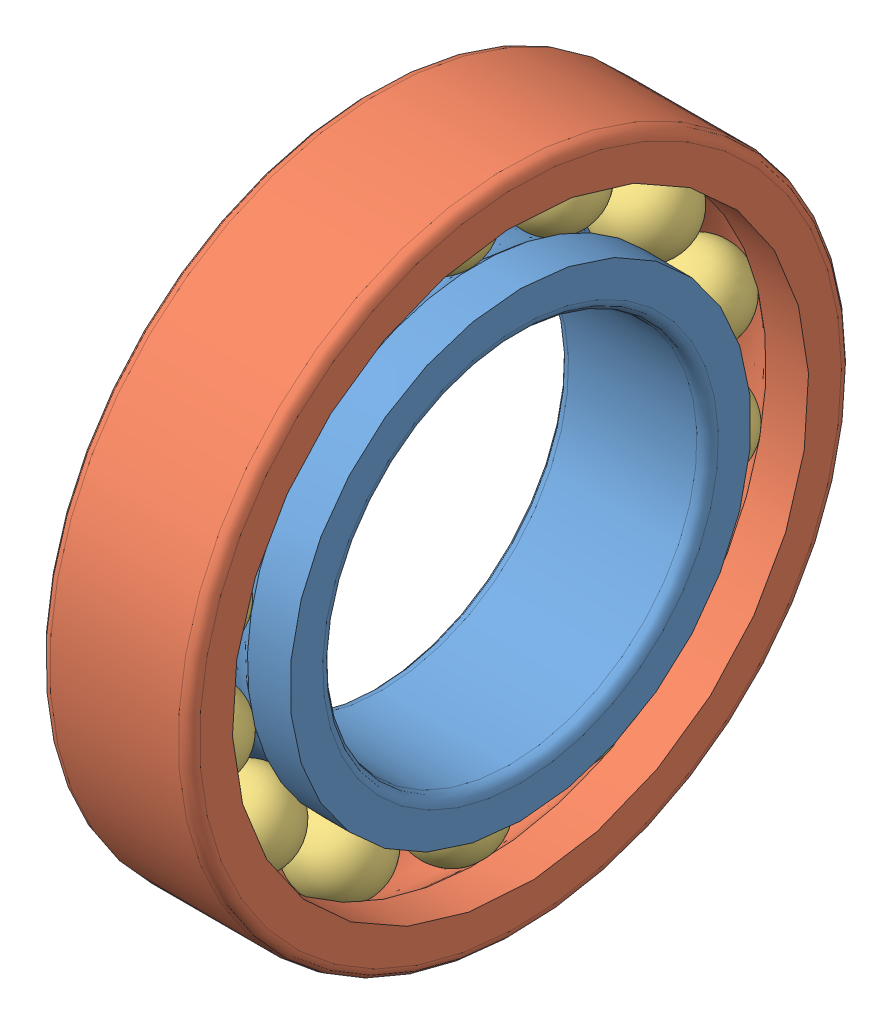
SolidWorks assembly Roulement radial à une rangée de billes 35x62x14.SLDASM, configuration Défaut (file format 4400). Lengths in mm.
Overall size (14 72.05 72.05).
19 component instances, 3 part files, 4 mates.
Components (placement in the parent):
- Roulement_r1rb_Bint66-1: Roulement_r1rb_Bint66.SLDPRT [Défaut] at origin size (14 43.1 43.1)
- Roulement_r1rb_Bext66-1: Roulement_r1rb_Bext66.SLDPRT [Défaut] x (1 0 0) z (0 0.178134 0.984006) size (14 62 62)
- Roulement_r1rb_Eroul66-1: Roulement_r1rb_Eroul66.SLDPRT [Défaut] x (1 0 0) z (0 0.412348 0.911027) size (8.1 8.1 8.1)
- Roulement_r1rb_Eroul66-10: Roulement_r1rb_Eroul66.SLDPRT [Défaut] x (1 0 0) z (0 -0.023767 0.999718) size (8.1 8.1 8.1)
- Roulement_r1rb_Eroul66-11: Roulement_r1rb_Eroul66.SLDPRT [Défaut] x (1 0 0) z (0 -0.455175 0.890402) size (8.1 8.1 8.1)
- Roulement_r1rb_Eroul66-12: Roulement_r1rb_Eroul66.SLDPRT [Défaut] x (1 0 0) z (0 -0.796429 0.604732) size (8.1 8.1 8.1)
- Roulement_r1rb_Eroul66-13: Roulement_r1rb_Eroul66.SLDPRT [Défaut] x (1 0 0) z (0 -0.979941 0.199287) size (8.1 8.1 8.1)
- Roulement_r1rb_Eroul66-14: Roulement_r1rb_Eroul66.SLDPRT [Défaut] x (1 0 0) z (0 -0.969364 -0.24563) size (8.1 8.1 8.1)
- Roulement_r1rb_Eroul66-15: Roulement_r1rb_Eroul66.SLDPRT [Défaut] x (1 0 0) z (0 -0.766792 -0.641896) size (8.1 8.1 8.1)
- Roulement_r1rb_Eroul66-16: Roulement_r1rb_Eroul66.SLDPRT [Défaut] x (1 0 0) z (0 -0.412348 -0.911027) size (8.1 8.1 8.1)
- Roulement_r1rb_Eroul66-17: Roulement_r1rb_Eroul66.SLDPRT [Défaut] x (1 0 0) z (0 -0.911027 0.412348) size (8.1 8.1 8.1) (suppressed, hidden)
- Roulement_r1rb_Eroul66-18: Roulement_r1rb_Eroul66.SLDPRT [Défaut] x (1 0 0) z (0 -0.412348 -0.911027) size (8.1 8.1 8.1) (suppressed, hidden)
- Roulement_r1rb_Eroul66-19: Roulement_r1rb_Eroul66.SLDPRT [Défaut] x (1 0 0) z (0 0.911027 -0.412348) size (8.1 8.1 8.1) (suppressed, hidden)
- Roulement_r1rb_Eroul66-20: Roulement_r1rb_Eroul66.SLDPRT [Défaut] x (1 0 0) z (0 0.023767 -0.999718) size (8.1 8.1 8.1)
- Roulement_r1rb_Eroul66-21: Roulement_r1rb_Eroul66.SLDPRT [Défaut] x (1 0 0) z (0 0.455175 -0.890402) size (8.1 8.1 8.1)
- Roulement_r1rb_Eroul66-22: Roulement_r1rb_Eroul66.SLDPRT [Défaut] x (1 0 0) z (0 0.796429 -0.604732) size (8.1 8.1 8.1)
- Roulement_r1rb_Eroul66-23: Roulement_r1rb_Eroul66.SLDPRT [Défaut] x (1 0 0) z (0 0.979941 -0.199287) size (8.1 8.1 8.1)
- Roulement_r1rb_Eroul66-24: Roulement_r1rb_Eroul66.SLDPRT [Défaut] x (1 0 0) z (0 0.969364 0.24563) size (8.1 8.1 8.1)
- Roulement_r1rb_Eroul66-25: Roulement_r1rb_Eroul66.SLDPRT [Défaut] x (1 0 0) z (0 0.766792 0.641896) size (8.1 8.1 8.1)
Mates (geometry in assembly coordinates):
- Coaxiale1: concentric aligned: cylinder of Roulement_r1rb_Bint66-1 through (0 0 0) axis (-1 0 0) radius 17.5; cylinder of Roulement_r1rb_Bext66-1 through (0 0 0) axis (-1 0 0) radius 31
- Coïncidente1: coincident: point of Roulement_r1rb_Bext66-1; point of assembly
- Coïncidente2: coincident aligned: line of Roulement_r1rb_Bint66-1 through (0 0 0) axis (1 0 0); line of Roulement_r1rb_Eroul66-1 through (0 0 0) axis (1 0 0)
- Coïncidente3: coincident: unknown of Roulement_r1rb_Eroul66-1
